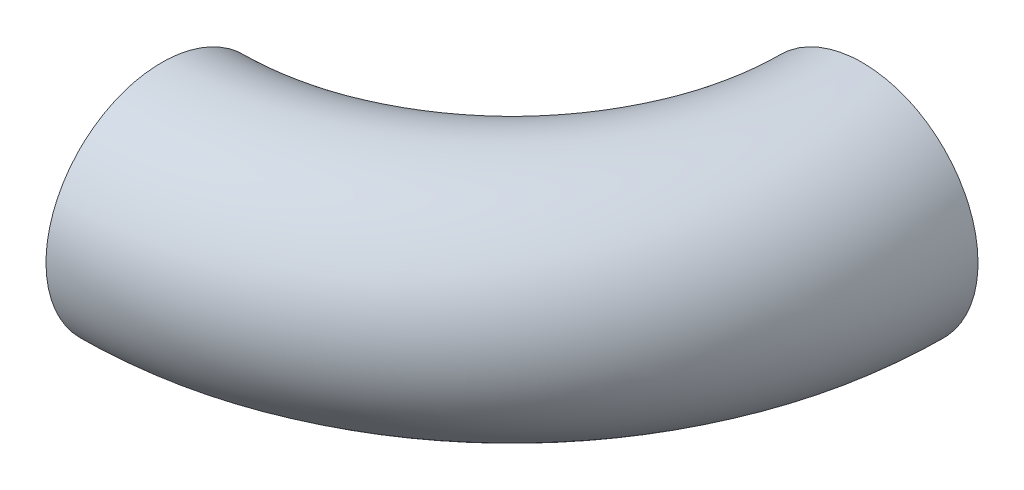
ISO-10303-21;
HEADER;
FILE_DESCRIPTION(('STEP AP214'),'2;1');
FILE_NAME('part.step','',(''),(''),'','','');
FILE_SCHEMA(('AUTOMOTIVE_DESIGN { 1 0 10303 214 1 1 1 1 }'));
ENDSEC;
DATA;
#1=APPLICATION_CONTEXT('core data for automotive mechanical design processes');
#2=APPLICATION_PROTOCOL_DEFINITION('international standard','automotive_design',2000,#1);
#3=PRODUCT_CONTEXT('',#1,'mechanical');
#4=PRODUCT('Part','Part','',(#3));
#5=PRODUCT_RELATED_PRODUCT_CATEGORY('part','',(#4));
#6=PRODUCT_DEFINITION_FORMATION('','',#4);
#7=PRODUCT_DEFINITION_CONTEXT('part definition',#1,'design');
#8=PRODUCT_DEFINITION('design','',#6,#7);
#9=PRODUCT_DEFINITION_SHAPE('','',#8);
#10=(LENGTH_UNIT() NAMED_UNIT(*) SI_UNIT(.MILLI.,.METRE.));
#11=(NAMED_UNIT(*) PLANE_ANGLE_UNIT() SI_UNIT($,.RADIAN.));
#12=(NAMED_UNIT(*) SI_UNIT($,.STERADIAN.) SOLID_ANGLE_UNIT());
#13=UNCERTAINTY_MEASURE_WITH_UNIT(LENGTH_MEASURE(1.E-05),#10,'distance_accuracy_value','');
#14=(GEOMETRIC_REPRESENTATION_CONTEXT(3) GLOBAL_UNCERTAINTY_ASSIGNED_CONTEXT((#13)) GLOBAL_UNIT_ASSIGNED_CONTEXT((#10,
#11,#12)) REPRESENTATION_CONTEXT('',''));
#15=CARTESIAN_POINT('',(0.,0.,0.));
#16=DIRECTION('',(0.,0.,1.));
#17=DIRECTION('',(1.,0.,0.));
#18=AXIS2_PLACEMENT_3D('',#15,#16,#17);
#19=CARTESIAN_POINT('',(15.890000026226,0.,2.8));
#20=DIRECTION('',(0.,0.,-1.));
#21=DIRECTION('',(0.,1.,0.));
#22=AXIS2_PLACEMENT_3D('',#19,#20,#21);
#23=PLANE('',#22);
#24=CARTESIAN_POINT('',(15.890000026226,0.,2.8));
#25=CARTESIAN_POINT('',(15.889998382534,0.0370724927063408,2.8));
#26=CARTESIAN_POINT('',(15.8868659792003,0.0741718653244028,2.8));
#27=CARTESIAN_POINT('',(15.8744136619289,0.147348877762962,2.8));
#28=CARTESIAN_POINT('',(15.8650863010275,0.183425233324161,2.8));
#29=CARTESIAN_POINT('',(15.8405112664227,0.253480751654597,2.8));
#30=CARTESIAN_POINT('',(15.8252672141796,0.287461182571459,2.8));
#31=CARTESIAN_POINT('',(15.7892903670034,0.352380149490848,2.8));
#32=CARTESIAN_POINT('',(15.7685574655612,0.383318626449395,2.8));
#33=CARTESIAN_POINT('',(15.722192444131,0.441275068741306,2.8));
#34=CARTESIAN_POINT('',(15.6965604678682,0.468293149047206,2.8));
#35=CARTESIAN_POINT('',(15.6411233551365,0.517643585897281,2.8));
#36=CARTESIAN_POINT('',(15.6113180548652,0.539975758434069,2.8));
#37=CARTESIAN_POINT('',(15.5483817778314,0.579318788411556,2.8));
#38=CARTESIAN_POINT('',(15.5152508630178,0.596329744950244,2.8));
#39=CARTESIAN_POINT('',(15.4466034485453,0.624547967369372,2.8));
#40=CARTESIAN_POINT('',(15.4110869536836,0.635755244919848,2.8));
#41=CARTESIAN_POINT('',(15.338676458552,0.652048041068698,2.8));
#42=CARTESIAN_POINT('',(15.3017824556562,0.65713354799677,2.8));
#43=CARTESIAN_POINT('',(15.2276643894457,0.661038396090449,2.8));
#44=CARTESIAN_POINT('',(15.1904403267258,0.659857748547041,2.8));
#45=CARTESIAN_POINT('',(15.1167187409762,0.651263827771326,2.8));
#46=CARTESIAN_POINT('',(15.0802212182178,0.643850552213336,2.8));
#47=CARTESIAN_POINT('',(15.0089887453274,0.623001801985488,2.8));
#48=CARTESIAN_POINT('',(14.9742537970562,0.609566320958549,2.8));
#49=CARTESIAN_POINT('',(14.9075325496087,0.57705455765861,2.8));
#50=CARTESIAN_POINT('',(14.875546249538,0.557978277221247,2.8));
#51=CARTESIAN_POINT('',(14.8152302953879,0.514726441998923,2.8));
#52=CARTESIAN_POINT('',(14.7869006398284,0.490550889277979,2.8));
#53=CARTESIAN_POINT('',(14.7347021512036,0.437786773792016,2.8));
#54=CARTESIAN_POINT('',(14.7108333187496,0.409198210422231,2.8));
#55=CARTESIAN_POINT('',(14.6682340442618,0.348419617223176,2.8));
#56=CARTESIAN_POINT('',(14.6495036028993,0.316229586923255,2.8));
#57=CARTESIAN_POINT('',(14.6177128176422,0.249161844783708,2.8));
#58=CARTESIAN_POINT('',(14.6046524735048,0.21428413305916,2.8));
#59=CARTESIAN_POINT('',(14.5845726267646,0.142831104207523,2.8));
#60=CARTESIAN_POINT('',(14.5775531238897,0.106255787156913,2.8));
#61=CARTESIAN_POINT('',(14.569754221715,0.0324458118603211,2.8));
#62=CARTESIAN_POINT('',(14.5689748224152,-0.00478884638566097,2.8));
#63=CARTESIAN_POINT('',(14.5736782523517,-0.0788605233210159,2.8));
#64=CARTESIAN_POINT('',(14.5791610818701,-0.115697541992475,2.8));
#65=CARTESIAN_POINT('',(14.5962333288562,-0.187928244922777,2.8));
#66=CARTESIAN_POINT('',(14.6078227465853,-0.223321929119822,2.8));
#67=CARTESIAN_POINT('',(14.6367791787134,-0.291661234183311,2.8));
#68=CARTESIAN_POINT('',(14.6541461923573,-0.324606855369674,2.8));
#69=CARTESIAN_POINT('',(14.6941648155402,-0.387114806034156,2.8));
#70=CARTESIAN_POINT('',(14.716816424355,-0.416677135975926,2.8));
#71=CARTESIAN_POINT('',(14.7667612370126,-0.471579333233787,2.8));
#72=CARTESIAN_POINT('',(14.7940544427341,-0.496919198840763,2.8));
#73=CARTESIAN_POINT('',(14.8525076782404,-0.542657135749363,2.8));
#74=CARTESIAN_POINT('',(14.8836677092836,-0.56305520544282,2.8));
#75=CARTESIAN_POINT('',(14.9489700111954,-0.598330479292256,2.8));
#76=CARTESIAN_POINT('',(14.983112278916,-0.613207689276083,2.8));
#77=CARTESIAN_POINT('',(15.0534098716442,-0.637018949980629,2.8));
#78=CARTESIAN_POINT('',(15.0895651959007,-0.645953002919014,2.8));
#79=CARTESIAN_POINT('',(15.1628626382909,-0.657624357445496,2.8));
#80=CARTESIAN_POINT('',(15.2000047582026,-0.660361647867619,2.8));
#81=CARTESIAN_POINT('',(15.2742213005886,-0.659561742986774,2.8));
#82=CARTESIAN_POINT('',(15.3112957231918,-0.656024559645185,2.8));
#83=CARTESIAN_POINT('',(15.3843245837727,-0.642776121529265,2.8));
#84=CARTESIAN_POINT('',(15.4202790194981,-0.633064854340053,2.8));
#85=CARTESIAN_POINT('',(15.4900478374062,-0.607743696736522,2.8));
#86=CARTESIAN_POINT('',(15.5238621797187,-0.592133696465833,2.8));
#87=CARTESIAN_POINT('',(15.5883888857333,-0.555458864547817,2.8));
#88=CARTESIAN_POINT('',(15.619101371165,-0.534394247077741,2.8));
#89=CARTESIAN_POINT('',(15.6765548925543,-0.487407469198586,2.8));
#90=CARTESIAN_POINT('',(15.7032958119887,-0.461485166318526,2.8));
#91=CARTESIAN_POINT('',(15.7520456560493,-0.405518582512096,2.8));
#92=CARTESIAN_POINT('',(15.7740546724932,-0.375474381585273,2.8));
#93=CARTESIAN_POINT('',(15.8127279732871,-0.31210180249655,2.8));
#94=CARTESIAN_POINT('',(15.8293889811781,-0.278771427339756,2.8));
#95=CARTESIAN_POINT('',(15.8568596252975,-0.209812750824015,2.8));
#96=CARTESIAN_POINT('',(15.8676762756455,-0.174187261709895,2.8));
#97=CARTESIAN_POINT('',(15.8802682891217,-0.115278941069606,2.8));
#98=CARTESIAN_POINT('',(15.8839131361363,-0.0923788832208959,2.8));
#99=CARTESIAN_POINT('',(15.8887795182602,-0.0463227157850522,2.8));
#100=CARTESIAN_POINT('',(15.8900010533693,-0.0231666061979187,2.8));
#101=CARTESIAN_POINT('',(15.890000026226,0.,2.8));
#102=B_SPLINE_CURVE_WITH_KNOTS('',3,(#24,#25,#26,#27,#28,#29,#30,#31,#32,#33,#34,#35,#36,#37,
#38,#39,#40,#41,#42,#43,#44,#45,#46,#47,#48,#49,#50,#51,#52,#53,#54,#55,#56,#57,#58,#59,#60,#61,
#62,#63,#64,#65,#66,#67,#68,#69,#70,#71,#72,#73,#74,#75,#76,#77,#78,#79,#80,#81,#82,#83,#84,#85,
#86,#87,#88,#89,#90,#91,#92,#93,#94,#95,#96,#97,#98,#99,#100,#101),.UNSPECIFIED.,.T.,.F.,(4,2,2,
2,2,2,2,2,2,2,2,2,2,2,2,2,2,2,2,2,2,2,2,2,2,2,2,2,2,2,2,2,2,2,2,2,2,2,4),(0.,0.11113292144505,
0.222399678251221,0.333598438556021,0.444799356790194,0.555997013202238,0.667199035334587,
0.778398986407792,0.889598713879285,1.0007986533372,1.11199839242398,1.22319817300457,
1.33439807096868,1.44559793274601,1.55679774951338,1.66799758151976,1.77919742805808,
1.89039726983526,2.00159710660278,2.1127969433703,2.22399678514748,2.33519663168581,
2.44639646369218,2.55759628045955,2.66879614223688,2.77999604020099,2.89119582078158,
3.00239555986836,3.11359549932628,3.22479522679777,3.33599517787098,3.44719720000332,
3.55839485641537,3.66959577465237,3.78079453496,3.892061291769,4.00319421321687,4.0726411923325,
4.14208817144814),.UNSPECIFIED.);
#103=CARTESIAN_POINT('',(15.890000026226,0.,2.8));
#104=VERTEX_POINT('',#103);
#105=EDGE_CURVE('E19',#104,#104,#102,.T.);
#106=ORIENTED_EDGE('',*,*,#105,.F.);
#107=EDGE_LOOP('',(#106));
#108=FACE_BOUND('',#107,.T.);
#109=ADVANCED_FACE('F15',(#108),#23,.T.);
#110=CARTESIAN_POINT('',(13.23,0.,5.460000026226));
#111=DIRECTION('',(1.,0.,0.));
#112=DIRECTION('',(0.,0.,-1.));
#113=AXIS2_PLACEMENT_3D('',#110,#111,#112);
#114=PLANE('',#113);
#115=CARTESIAN_POINT('',(13.23,0.,5.460000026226));
#116=CARTESIAN_POINT('',(13.23,-0.0370724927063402,5.45999838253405));
#117=CARTESIAN_POINT('',(13.23,-0.074171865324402,5.45686597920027));
#118=CARTESIAN_POINT('',(13.23,-0.147348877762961,5.44441366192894));
#119=CARTESIAN_POINT('',(13.23,-0.18342523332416,5.43508630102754));
#120=CARTESIAN_POINT('',(13.23,-0.253480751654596,5.41051126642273));
#121=CARTESIAN_POINT('',(13.23,-0.287461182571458,5.39526721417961));
#122=CARTESIAN_POINT('',(13.23,-0.352380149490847,5.35929036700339));
#123=CARTESIAN_POINT('',(13.23,-0.383318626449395,5.33855746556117));
#124=CARTESIAN_POINT('',(13.23,-0.441275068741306,5.29219244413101));
#125=CARTESIAN_POINT('',(13.23,-0.468293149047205,5.26656046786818));
#126=CARTESIAN_POINT('',(13.23,-0.51764358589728,5.21112335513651));
#127=CARTESIAN_POINT('',(13.23,-0.539975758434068,5.18131805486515));
#128=CARTESIAN_POINT('',(13.23,-0.579318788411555,5.11838177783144));
#129=CARTESIAN_POINT('',(13.23,-0.596329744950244,5.0852508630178));
#130=CARTESIAN_POINT('',(13.23,-0.624547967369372,5.01660344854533));
#131=CARTESIAN_POINT('',(13.23,-0.635755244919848,4.98108695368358));
#132=CARTESIAN_POINT('',(13.23,-0.652048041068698,4.90867645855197));
#133=CARTESIAN_POINT('',(13.23,-0.65713354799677,4.87178245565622));
#134=CARTESIAN_POINT('',(13.23,-0.661038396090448,4.79766438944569));
#135=CARTESIAN_POINT('',(13.23,-0.65985774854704,4.76044032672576));
#136=CARTESIAN_POINT('',(13.23,-0.651263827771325,4.68671874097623));
#137=CARTESIAN_POINT('',(13.23,-0.643850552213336,4.65022121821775));
#138=CARTESIAN_POINT('',(13.23,-0.623001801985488,4.57898874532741));
#139=CARTESIAN_POINT('',(13.23,-0.609566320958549,4.54425379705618));
#140=CARTESIAN_POINT('',(13.23,-0.57705455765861,4.47753254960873));
#141=CARTESIAN_POINT('',(13.23,-0.557978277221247,4.44554624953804));
#142=CARTESIAN_POINT('',(13.23,-0.514726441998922,4.38523029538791));
#143=CARTESIAN_POINT('',(13.23,-0.490550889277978,4.35690063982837));
#144=CARTESIAN_POINT('',(13.23,-0.437786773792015,4.30470215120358));
#145=CARTESIAN_POINT('',(13.23,-0.40919821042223,4.28083331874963));
#146=CARTESIAN_POINT('',(13.23,-0.348419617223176,4.23823404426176));
#147=CARTESIAN_POINT('',(13.23,-0.316229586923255,4.21950360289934));
#148=CARTESIAN_POINT('',(13.23,-0.249161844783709,4.18771281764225));
#149=CARTESIAN_POINT('',(13.23,-0.21428413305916,4.17465247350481));
#150=CARTESIAN_POINT('',(13.23,-0.142831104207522,4.15457262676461));
#151=CARTESIAN_POINT('',(13.23,-0.106255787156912,4.1475531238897));
#152=CARTESIAN_POINT('',(13.23,-0.0324458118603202,4.13975422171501));
#153=CARTESIAN_POINT('',(13.23,0.00478884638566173,4.13897482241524));
#154=CARTESIAN_POINT('',(13.23,0.0788605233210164,4.14367825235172));
#155=CARTESIAN_POINT('',(13.23,0.115697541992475,4.14916108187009));
#156=CARTESIAN_POINT('',(13.23,0.187928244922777,4.16623332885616));
#157=CARTESIAN_POINT('',(13.23,0.223321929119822,4.17782274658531));
#158=CARTESIAN_POINT('',(13.23,0.291661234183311,4.2067791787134));
#159=CARTESIAN_POINT('',(13.23,0.324606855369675,4.2241461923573));
#160=CARTESIAN_POINT('',(13.23,0.387114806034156,4.26416481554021));
#161=CARTESIAN_POINT('',(13.23,0.416677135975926,4.28681642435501));
#162=CARTESIAN_POINT('',(13.23,0.471579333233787,4.33676123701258));
#163=CARTESIAN_POINT('',(13.23,0.496919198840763,4.3640544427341));
#164=CARTESIAN_POINT('',(13.23,0.542657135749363,4.42250767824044));
#165=CARTESIAN_POINT('',(13.23,0.563055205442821,4.45366770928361));
#166=CARTESIAN_POINT('',(13.23,0.598330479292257,4.51897001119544));
#167=CARTESIAN_POINT('',(13.23,0.613207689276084,4.55311227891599));
#168=CARTESIAN_POINT('',(13.23,0.637018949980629,4.62340987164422));
#169=CARTESIAN_POINT('',(13.23,0.645953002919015,4.65956519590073));
#170=CARTESIAN_POINT('',(13.23,0.657624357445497,4.7328626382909));
#171=CARTESIAN_POINT('',(13.23,0.66036164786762,4.77000475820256));
#172=CARTESIAN_POINT('',(13.23,0.659561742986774,4.84422130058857));
#173=CARTESIAN_POINT('',(13.23,0.656024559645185,4.88129572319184));
#174=CARTESIAN_POINT('',(13.23,0.642776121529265,4.95432458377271));
#175=CARTESIAN_POINT('',(13.23,0.633064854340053,4.99027901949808));
#176=CARTESIAN_POINT('',(13.23,0.607743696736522,5.06004783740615));
#177=CARTESIAN_POINT('',(13.23,0.592133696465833,5.09386217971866));
#178=CARTESIAN_POINT('',(13.23,0.555458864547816,5.15838888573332));
#179=CARTESIAN_POINT('',(13.23,0.534394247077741,5.18910137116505));
#180=CARTESIAN_POINT('',(13.23,0.487407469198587,5.24655489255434));
#181=CARTESIAN_POINT('',(13.23,0.461485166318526,5.27329581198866));
#182=CARTESIAN_POINT('',(13.23,0.405518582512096,5.32204565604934));
#183=CARTESIAN_POINT('',(13.23,0.375474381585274,5.34405467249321));
#184=CARTESIAN_POINT('',(13.23,0.312101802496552,5.38272797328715));
#185=CARTESIAN_POINT('',(13.23,0.278771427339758,5.39938898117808));
#186=CARTESIAN_POINT('',(13.23,0.209812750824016,5.42685962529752));
#187=CARTESIAN_POINT('',(13.23,0.174187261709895,5.43767627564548));
#188=CARTESIAN_POINT('',(13.23,0.115278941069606,5.45026828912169));
#189=CARTESIAN_POINT('',(13.23,0.0923788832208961,5.45391313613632));
#190=CARTESIAN_POINT('',(13.23,0.0463227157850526,5.45877951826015));
#191=CARTESIAN_POINT('',(13.23,0.0231666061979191,5.46000105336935));
#192=CARTESIAN_POINT('',(13.23,0.,5.460000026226));
#193=B_SPLINE_CURVE_WITH_KNOTS('',3,(#115,#116,#117,#118,#119,#120,#121,#122,#123,#124,#125,
#126,#127,#128,#129,#130,#131,#132,#133,#134,#135,#136,#137,#138,#139,#140,#141,#142,#143,#144,
#145,#146,#147,#148,#149,#150,#151,#152,#153,#154,#155,#156,#157,#158,#159,#160,#161,#162,#163,
#164,#165,#166,#167,#168,#169,#170,#171,#172,#173,#174,#175,#176,#177,#178,#179,#180,#181,#182,
#183,#184,#185,#186,#187,#188,#189,#190,#191,#192),.UNSPECIFIED.,.T.,.F.,(4,2,2,2,2,2,2,2,2,2,2,
2,2,2,2,2,2,2,2,2,2,2,2,2,2,2,2,2,2,2,2,2,2,2,2,2,2,2,4),(0.,0.11113292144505,0.22239967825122,
0.333598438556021,0.444799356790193,0.555997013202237,0.667199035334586,0.778398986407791,
0.889598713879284,1.0007986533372,1.11199839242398,1.22319817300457,1.33439807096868,
1.44559793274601,1.55679774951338,1.66799758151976,1.77919742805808,1.89039726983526,
2.00159710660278,2.1127969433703,2.22399678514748,2.33519663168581,2.44639646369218,
2.55759628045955,2.66879614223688,2.77999604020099,2.89119582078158,3.00239555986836,
3.11359549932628,3.22479522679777,3.33599517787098,3.44719720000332,3.55839485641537,
3.66959577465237,3.78079453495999,3.892061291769,4.00319421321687,4.0726411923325,
4.14208817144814),.UNSPECIFIED.);
#194=CARTESIAN_POINT('',(13.23,0.,5.460000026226));
#195=VERTEX_POINT('',#194);
#196=EDGE_CURVE('E10',#195,#195,#193,.T.);
#197=ORIENTED_EDGE('',*,*,#196,.F.);
#198=EDGE_LOOP('',(#197));
#199=FACE_BOUND('',#198,.T.);
#200=ADVANCED_FACE('F33',(#199),#114,.F.);
#201=CARTESIAN_POINT('',(13.23,0.,2.8));
#202=DIRECTION('',(0.,1.,0.));
#203=DIRECTION('',(1.,0.,0.));
#204=AXIS2_PLACEMENT_3D('',#201,#202,#203);
#205=TOROIDAL_SURFACE('',#204,2.,0.660000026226);
#206=ORIENTED_EDGE('',*,*,#196,.T.);
#207=EDGE_LOOP('',(#206));
#208=FACE_BOUND('',#207,.T.);
#209=ORIENTED_EDGE('',*,*,#105,.T.);
#210=EDGE_LOOP('',(#209));
#211=FACE_BOUND('',#210,.T.);
#212=ADVANCED_FACE('F35',(#208,#211),#205,.T.);
#213=CLOSED_SHELL('',(#109,#200,#212));
#214=MANIFOLD_SOLID_BREP('B1',#213);
#215=ADVANCED_BREP_SHAPE_REPRESENTATION('',(#18,#214),#14);
#216=SHAPE_DEFINITION_REPRESENTATION(#9,#215);
ENDSEC;
END-ISO-10303-21;
